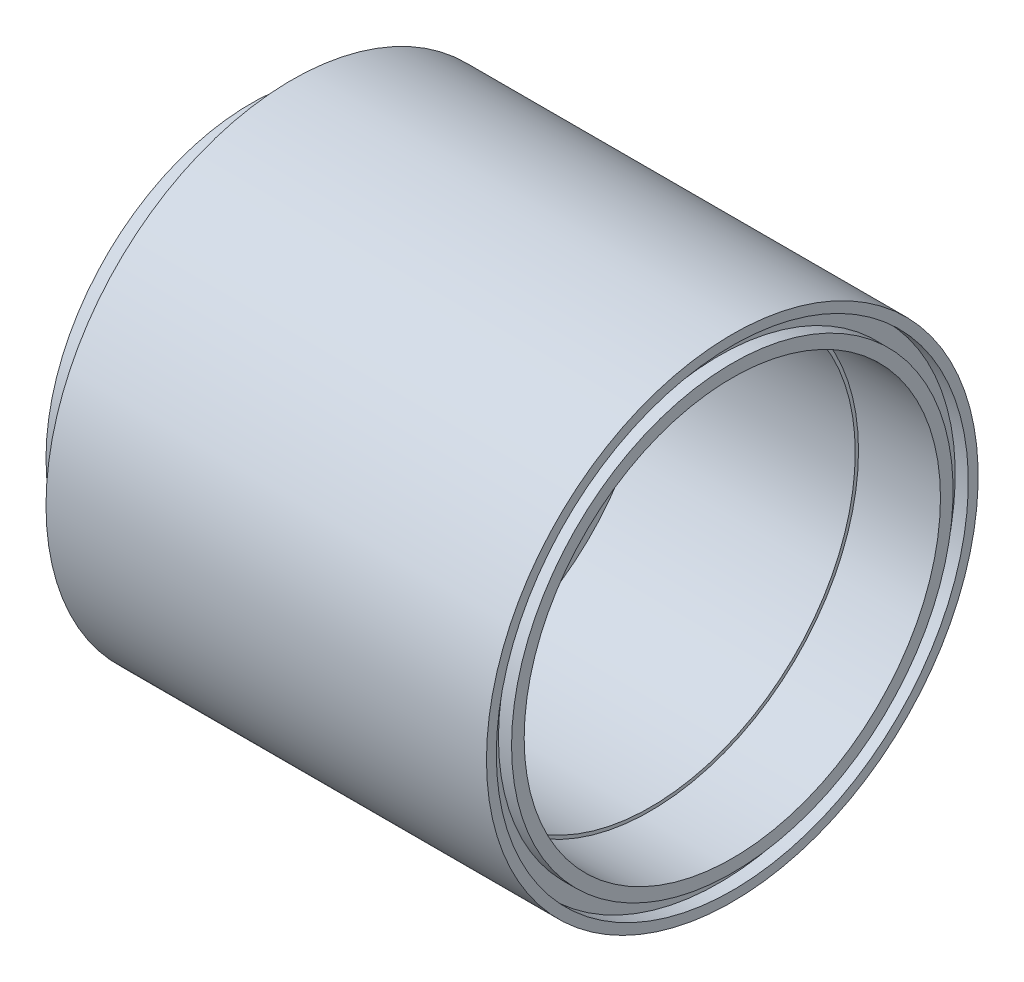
ISO-10303-21;
HEADER;
FILE_DESCRIPTION(('STEP AP214'),'2;1');
FILE_NAME('part.step','',(''),(''),'','','');
FILE_SCHEMA(('AUTOMOTIVE_DESIGN { 1 0 10303 214 1 1 1 1 }'));
ENDSEC;
DATA;
#1=APPLICATION_CONTEXT('core data for automotive mechanical design processes');
#2=APPLICATION_PROTOCOL_DEFINITION('international standard','automotive_design',2000,#1);
#3=PRODUCT_CONTEXT('',#1,'mechanical');
#4=PRODUCT('Part','Part','',(#3));
#5=PRODUCT_RELATED_PRODUCT_CATEGORY('part','',(#4));
#6=PRODUCT_DEFINITION_FORMATION('','',#4);
#7=PRODUCT_DEFINITION_CONTEXT('part definition',#1,'design');
#8=PRODUCT_DEFINITION('design','',#6,#7);
#9=PRODUCT_DEFINITION_SHAPE('','',#8);
#10=(LENGTH_UNIT() NAMED_UNIT(*) SI_UNIT(.MILLI.,.METRE.));
#11=(NAMED_UNIT(*) PLANE_ANGLE_UNIT() SI_UNIT($,.RADIAN.));
#12=(NAMED_UNIT(*) SI_UNIT($,.STERADIAN.) SOLID_ANGLE_UNIT());
#13=UNCERTAINTY_MEASURE_WITH_UNIT(LENGTH_MEASURE(1.E-05),#10,'distance_accuracy_value','');
#14=(GEOMETRIC_REPRESENTATION_CONTEXT(3) GLOBAL_UNCERTAINTY_ASSIGNED_CONTEXT((#13)) GLOBAL_UNIT_ASSIGNED_CONTEXT((#10,
#11,#12)) REPRESENTATION_CONTEXT('',''));
#15=CARTESIAN_POINT('',(0.,0.,0.));
#16=DIRECTION('',(0.,0.,1.));
#17=DIRECTION('',(1.,0.,0.));
#18=AXIS2_PLACEMENT_3D('',#15,#16,#17);
#19=CARTESIAN_POINT('',(-4.7625,0.,0.));
#20=DIRECTION('',(-1.,0.,0.));
#21=DIRECTION('',(0.,0.,1.));
#22=AXIS2_PLACEMENT_3D('',#19,#20,#21);
#23=CYLINDRICAL_SURFACE('',#22,27.051);
#24=CARTESIAN_POINT('',(-11.1125,0.,0.));
#25=DIRECTION('',(-1.,0.,0.));
#26=DIRECTION('',(0.,0.,1.));
#27=AXIS2_PLACEMENT_3D('',#24,#25,#26);
#28=CIRCLE('',#27,27.051);
#29=CARTESIAN_POINT('',(-11.1125,0.,27.051));
#30=VERTEX_POINT('',#29);
#31=EDGE_CURVE('E101',#30,#30,#28,.T.);
#32=ORIENTED_EDGE('',*,*,#31,.T.);
#33=EDGE_LOOP('',(#32));
#34=FACE_BOUND('',#33,.T.);
#35=CARTESIAN_POINT('',(-9.4615,0.,0.));
#36=DIRECTION('',(-1.,0.,0.));
#37=DIRECTION('',(0.,0.,1.));
#38=AXIS2_PLACEMENT_3D('',#35,#36,#37);
#39=CIRCLE('',#38,27.051);
#40=CARTESIAN_POINT('',(-9.4615,0.,27.051));
#41=VERTEX_POINT('',#40);
#42=EDGE_CURVE('E10',#41,#41,#39,.T.);
#43=ORIENTED_EDGE('',*,*,#42,.F.);
#44=EDGE_LOOP('',(#43));
#45=FACE_BOUND('',#44,.T.);
#46=ADVANCED_FACE('F37',(#34,#45),#23,.F.);
#47=CARTESIAN_POINT('',(-9.4615,0.,0.));
#48=DIRECTION('',(-1.,0.,0.));
#49=DIRECTION('',(0.,0.,1.));
#50=AXIS2_PLACEMENT_3D('',#47,#48,#49);
#51=PLANE('',#50);
#52=ORIENTED_EDGE('',*,*,#42,.T.);
#53=EDGE_LOOP('',(#52));
#54=FACE_BOUND('',#53,.T.);
#55=CARTESIAN_POINT('',(-9.4615,0.,0.));
#56=DIRECTION('',(-1.,0.,0.));
#57=DIRECTION('',(0.,0.,1.));
#58=AXIS2_PLACEMENT_3D('',#55,#56,#57);
#59=CIRCLE('',#58,25.4);
#60=CARTESIAN_POINT('',(-9.4615,0.,25.4));
#61=VERTEX_POINT('',#60);
#62=EDGE_CURVE('E43',#61,#61,#59,.T.);
#63=ORIENTED_EDGE('',*,*,#62,.F.);
#64=EDGE_LOOP('',(#63));
#65=FACE_BOUND('',#64,.T.);
#66=ADVANCED_FACE('F229',(#54,#65),#51,.T.);
#67=CARTESIAN_POINT('',(-4.7625,0.,0.));
#68=DIRECTION('',(-1.,0.,0.));
#69=DIRECTION('',(0.,0.,1.));
#70=AXIS2_PLACEMENT_3D('',#67,#68,#69);
#71=CYLINDRICAL_SURFACE('',#70,25.4);
#72=ORIENTED_EDGE('',*,*,#62,.T.);
#73=EDGE_LOOP('',(#72));
#74=FACE_BOUND('',#73,.T.);
#75=CARTESIAN_POINT('',(-11.1125,0.,0.));
#76=DIRECTION('',(-1.,0.,0.));
#77=DIRECTION('',(0.,0.,1.));
#78=AXIS2_PLACEMENT_3D('',#75,#76,#77);
#79=CIRCLE('',#78,25.4);
#80=CARTESIAN_POINT('',(-11.1125,0.,25.4));
#81=VERTEX_POINT('',#80);
#82=EDGE_CURVE('E47',#81,#81,#79,.T.);
#83=ORIENTED_EDGE('',*,*,#82,.F.);
#84=EDGE_LOOP('',(#83));
#85=FACE_BOUND('',#84,.T.);
#86=ADVANCED_FACE('F234',(#74,#85),#71,.T.);
#87=CARTESIAN_POINT('',(-11.1125,0.,0.));
#88=DIRECTION('',(1.,0.,0.));
#89=DIRECTION('',(0.,0.,-1.));
#90=AXIS2_PLACEMENT_3D('',#87,#88,#89);
#91=PLANE('',#90);
#92=CARTESIAN_POINT('',(-11.1125,0.,0.));
#93=DIRECTION('',(-1.,0.,0.));
#94=DIRECTION('',(0.,0.,1.));
#95=AXIS2_PLACEMENT_3D('',#92,#93,#94);
#96=CIRCLE('',#95,22.86);
#97=CARTESIAN_POINT('',(-11.1125,0.,22.86));
#98=VERTEX_POINT('',#97);
#99=EDGE_CURVE('E51',#98,#98,#96,.T.);
#100=ORIENTED_EDGE('',*,*,#99,.F.);
#101=EDGE_LOOP('',(#100));
#102=FACE_BOUND('',#101,.T.);
#103=ORIENTED_EDGE('',*,*,#82,.T.);
#104=EDGE_LOOP('',(#103));
#105=FACE_BOUND('',#104,.T.);
#106=ADVANCED_FACE('F244',(#102,#105),#91,.F.);
#107=CARTESIAN_POINT('',(-4.7625,0.,0.));
#108=DIRECTION('',(-1.,0.,0.));
#109=DIRECTION('',(0.,0.,1.));
#110=AXIS2_PLACEMENT_3D('',#107,#108,#109);
#111=CYLINDRICAL_SURFACE('',#110,22.86);
#112=CARTESIAN_POINT('',(-4.7625,0.,0.));
#113=DIRECTION('',(-1.,0.,0.));
#114=DIRECTION('',(0.,0.,1.));
#115=AXIS2_PLACEMENT_3D('',#112,#113,#114);
#116=CIRCLE('',#115,22.86);
#117=CARTESIAN_POINT('',(-4.7625,0.,22.86));
#118=VERTEX_POINT('',#117);
#119=EDGE_CURVE('E56',#118,#118,#116,.T.);
#120=ORIENTED_EDGE('',*,*,#119,.F.);
#121=EDGE_LOOP('',(#120));
#122=FACE_BOUND('',#121,.T.);
#123=ORIENTED_EDGE('',*,*,#99,.T.);
#124=EDGE_LOOP('',(#123));
#125=FACE_BOUND('',#124,.T.);
#126=ADVANCED_FACE('F433',(#122,#125),#111,.F.);
#127=CARTESIAN_POINT('',(-4.7625,0.,0.));
#128=DIRECTION('',(1.,0.,0.));
#129=DIRECTION('',(0.,0.,-1.));
#130=AXIS2_PLACEMENT_3D('',#127,#128,#129);
#131=PLANE('',#130);
#132=CARTESIAN_POINT('',(-4.7625,6.35,0.));
#133=DIRECTION('',(-1.,0.,0.));
#134=DIRECTION('',(0.,0.,1.));
#135=AXIS2_PLACEMENT_3D('',#132,#133,#134);
#136=CIRCLE('',#135,2.54);
#137=CARTESIAN_POINT('',(-4.7625,6.35,2.54));
#138=VERTEX_POINT('',#137);
#139=EDGE_CURVE('E119',#138,#138,#136,.T.);
#140=ORIENTED_EDGE('',*,*,#139,.F.);
#141=EDGE_LOOP('',(#140));
#142=FACE_BOUND('',#141,.T.);
#143=CARTESIAN_POINT('',(-4.7625,0.,8.509));
#144=DIRECTION('',(-1.,0.,0.));
#145=DIRECTION('',(0.,0.,1.));
#146=AXIS2_PLACEMENT_3D('',#143,#144,#145);
#147=CIRCLE('',#146,1.778);
#148=CARTESIAN_POINT('',(-4.7625,0.,10.287));
#149=VERTEX_POINT('',#148);
#150=EDGE_CURVE('E113',#149,#149,#147,.T.);
#151=ORIENTED_EDGE('',*,*,#150,.F.);
#152=EDGE_LOOP('',(#151));
#153=FACE_BOUND('',#152,.T.);
#154=CARTESIAN_POINT('',(-4.7625,0.,-8.509));
#155=DIRECTION('',(-1.,0.,0.));
#156=DIRECTION('',(0.,0.,1.));
#157=AXIS2_PLACEMENT_3D('',#154,#155,#156);
#158=CIRCLE('',#157,1.778);
#159=CARTESIAN_POINT('',(-4.7625,0.,-6.731));
#160=VERTEX_POINT('',#159);
#161=EDGE_CURVE('E107',#160,#160,#158,.T.);
#162=ORIENTED_EDGE('',*,*,#161,.F.);
#163=EDGE_LOOP('',(#162));
#164=FACE_BOUND('',#163,.T.);
#165=ORIENTED_EDGE('',*,*,#119,.T.);
#166=EDGE_LOOP('',(#165));
#167=FACE_BOUND('',#166,.T.);
#168=ADVANCED_FACE('F153',(#142,#153,#164,#167),#131,.F.);
#169=CARTESIAN_POINT('',(0.,0.,0.));
#170=DIRECTION('',(-1.,0.,0.));
#171=DIRECTION('',(0.,0.,1.));
#172=AXIS2_PLACEMENT_3D('',#169,#170,#171);
#173=PLANE('',#172);
#174=CARTESIAN_POINT('',(0.,23.114,0.));
#175=DIRECTION('',(1.,0.,0.));
#176=DIRECTION('',(0.,0.,-1.));
#177=AXIS2_PLACEMENT_3D('',#174,#175,#176);
#178=CIRCLE('',#177,0.88899999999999);
#179=CARTESIAN_POINT('',(0.,23.114,-0.88899999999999));
#180=VERTEX_POINT('',#179);
#181=EDGE_CURVE('E143',#180,#180,#178,.T.);
#182=ORIENTED_EDGE('',*,*,#181,.F.);
#183=EDGE_LOOP('',(#182));
#184=FACE_BOUND('',#183,.T.);
#185=CARTESIAN_POINT('',(0.,0.,-23.114));
#186=DIRECTION('',(1.,0.,0.));
#187=DIRECTION('',(0.,0.,-1.));
#188=AXIS2_PLACEMENT_3D('',#185,#186,#187);
#189=CIRCLE('',#188,0.888999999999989);
#190=CARTESIAN_POINT('',(0.,0.,-24.003));
#191=VERTEX_POINT('',#190);
#192=EDGE_CURVE('E137',#191,#191,#189,.T.);
#193=ORIENTED_EDGE('',*,*,#192,.F.);
#194=EDGE_LOOP('',(#193));
#195=FACE_BOUND('',#194,.T.);
#196=CARTESIAN_POINT('',(0.,-23.114,0.));
#197=DIRECTION('',(1.,0.,0.));
#198=DIRECTION('',(0.,0.,-1.));
#199=AXIS2_PLACEMENT_3D('',#196,#197,#198);
#200=CIRCLE('',#199,0.88899999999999);
#201=CARTESIAN_POINT('',(0.,-23.114,-0.88899999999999));
#202=VERTEX_POINT('',#201);
#203=EDGE_CURVE('E131',#202,#202,#200,.T.);
#204=ORIENTED_EDGE('',*,*,#203,.F.);
#205=EDGE_LOOP('',(#204));
#206=FACE_BOUND('',#205,.T.);
#207=CARTESIAN_POINT('',(0.,0.,23.114));
#208=DIRECTION('',(1.,0.,0.));
#209=DIRECTION('',(0.,0.,-1.));
#210=AXIS2_PLACEMENT_3D('',#207,#208,#209);
#211=CIRCLE('',#210,0.888999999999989);
#212=CARTESIAN_POINT('',(0.,0.,22.225));
#213=VERTEX_POINT('',#212);
#214=EDGE_CURVE('E125',#213,#213,#211,.T.);
#215=ORIENTED_EDGE('',*,*,#214,.F.);
#216=EDGE_LOOP('',(#215));
#217=FACE_BOUND('',#216,.T.);
#218=CARTESIAN_POINT('',(0.,6.35,0.));
#219=DIRECTION('',(-1.,0.,0.));
#220=DIRECTION('',(0.,0.,1.));
#221=AXIS2_PLACEMENT_3D('',#218,#219,#220);
#222=CIRCLE('',#221,2.54);
#223=CARTESIAN_POINT('',(0.,6.35,2.54));
#224=VERTEX_POINT('',#223);
#225=EDGE_CURVE('E116',#224,#224,#222,.F.);
#226=ORIENTED_EDGE('',*,*,#225,.F.);
#227=EDGE_LOOP('',(#226));
#228=FACE_BOUND('',#227,.T.);
#229=CARTESIAN_POINT('',(0.,0.,8.509));
#230=DIRECTION('',(-1.,0.,0.));
#231=DIRECTION('',(0.,0.,1.));
#232=AXIS2_PLACEMENT_3D('',#229,#230,#231);
#233=CIRCLE('',#232,1.778);
#234=CARTESIAN_POINT('',(0.,0.,10.287));
#235=VERTEX_POINT('',#234);
#236=EDGE_CURVE('E110',#235,#235,#233,.F.);
#237=ORIENTED_EDGE('',*,*,#236,.F.);
#238=EDGE_LOOP('',(#237));
#239=FACE_BOUND('',#238,.T.);
#240=CARTESIAN_POINT('',(0.,0.,-8.509));
#241=DIRECTION('',(-1.,0.,0.));
#242=DIRECTION('',(0.,0.,1.));
#243=AXIS2_PLACEMENT_3D('',#240,#241,#242);
#244=CIRCLE('',#243,1.778);
#245=CARTESIAN_POINT('',(0.,0.,-6.731));
#246=VERTEX_POINT('',#245);
#247=EDGE_CURVE('E104',#246,#246,#244,.F.);
#248=ORIENTED_EDGE('',*,*,#247,.F.);
#249=EDGE_LOOP('',(#248));
#250=FACE_BOUND('',#249,.T.);
#251=CARTESIAN_POINT('',(0.,0.,0.));
#252=DIRECTION('',(-1.,0.,0.));
#253=DIRECTION('',(0.,0.,1.));
#254=AXIS2_PLACEMENT_3D('',#251,#252,#253);
#255=CIRCLE('',#254,31.75);
#256=CARTESIAN_POINT('',(0.,0.,31.75));
#257=VERTEX_POINT('',#256);
#258=EDGE_CURVE('E59',#257,#257,#255,.T.);
#259=ORIENTED_EDGE('',*,*,#258,.F.);
#260=EDGE_LOOP('',(#259));
#261=FACE_BOUND('',#260,.T.);
#262=ADVANCED_FACE('F149',(#184,#195,#206,#217,#228,#239,#250,#261),#173,.F.);
#263=CARTESIAN_POINT('',(-4.7625,0.,0.));
#264=DIRECTION('',(-1.,0.,0.));
#265=DIRECTION('',(0.,0.,1.));
#266=AXIS2_PLACEMENT_3D('',#263,#264,#265);
#267=CYLINDRICAL_SURFACE('',#266,31.75);
#268=ORIENTED_EDGE('',*,*,#258,.T.);
#269=EDGE_LOOP('',(#268));
#270=FACE_BOUND('',#269,.T.);
#271=CARTESIAN_POINT('',(31.75,0.,0.));
#272=DIRECTION('',(-1.,0.,0.));
#273=DIRECTION('',(0.,0.,1.));
#274=AXIS2_PLACEMENT_3D('',#271,#272,#273);
#275=CIRCLE('',#274,31.75);
#276=CARTESIAN_POINT('',(31.75,0.,31.75));
#277=VERTEX_POINT('',#276);
#278=EDGE_CURVE('E62',#277,#277,#275,.T.);
#279=ORIENTED_EDGE('',*,*,#278,.F.);
#280=EDGE_LOOP('',(#279));
#281=FACE_BOUND('',#280,.T.);
#282=ADVANCED_FACE('F152',(#270,#281),#267,.F.);
#283=CARTESIAN_POINT('',(31.75,0.,0.));
#284=DIRECTION('',(1.,0.,0.));
#285=DIRECTION('',(0.,0.,-1.));
#286=AXIS2_PLACEMENT_3D('',#283,#284,#285);
#287=PLANE('',#286);
#288=ORIENTED_EDGE('',*,*,#278,.T.);
#289=EDGE_LOOP('',(#288));
#290=FACE_BOUND('',#289,.T.);
#291=CARTESIAN_POINT('',(31.75,0.,0.));
#292=DIRECTION('',(-1.,0.,0.));
#293=DIRECTION('',(0.,0.,1.));
#294=AXIS2_PLACEMENT_3D('',#291,#292,#293);
#295=CIRCLE('',#294,32.258);
#296=CARTESIAN_POINT('',(31.75,0.,32.258));
#297=VERTEX_POINT('',#296);
#298=EDGE_CURVE('E65',#297,#297,#295,.T.);
#299=ORIENTED_EDGE('',*,*,#298,.F.);
#300=EDGE_LOOP('',(#299));
#301=FACE_BOUND('',#300,.T.);
#302=ADVANCED_FACE('F171',(#290,#301),#287,.T.);
#303=CARTESIAN_POINT('',(-4.7625,0.,0.));
#304=DIRECTION('',(-1.,0.,0.));
#305=DIRECTION('',(0.,0.,1.));
#306=AXIS2_PLACEMENT_3D('',#303,#304,#305);
#307=CYLINDRICAL_SURFACE('',#306,32.258);
#308=ORIENTED_EDGE('',*,*,#298,.T.);
#309=EDGE_LOOP('',(#308));
#310=FACE_BOUND('',#309,.T.);
#311=CARTESIAN_POINT('',(44.45,0.,0.));
#312=DIRECTION('',(-1.,0.,0.));
#313=DIRECTION('',(0.,0.,1.));
#314=AXIS2_PLACEMENT_3D('',#311,#312,#313);
#315=CIRCLE('',#314,32.258);
#316=CARTESIAN_POINT('',(44.45,0.,32.258));
#317=VERTEX_POINT('',#316);
#318=EDGE_CURVE('E68',#317,#317,#315,.T.);
#319=ORIENTED_EDGE('',*,*,#318,.F.);
#320=EDGE_LOOP('',(#319));
#321=FACE_BOUND('',#320,.T.);
#322=ADVANCED_FACE('F177',(#310,#321),#307,.F.);
#323=CARTESIAN_POINT('',(44.45,0.,0.));
#324=DIRECTION('',(1.,0.,0.));
#325=DIRECTION('',(0.,0.,-1.));
#326=AXIS2_PLACEMENT_3D('',#323,#324,#325);
#327=PLANE('',#326);
#328=ORIENTED_EDGE('',*,*,#318,.T.);
#329=EDGE_LOOP('',(#328));
#330=FACE_BOUND('',#329,.T.);
#331=CARTESIAN_POINT('',(44.45,0.,0.));
#332=DIRECTION('',(-1.,0.,0.));
#333=DIRECTION('',(0.,0.,1.));
#334=AXIS2_PLACEMENT_3D('',#331,#332,#333);
#335=CIRCLE('',#334,34.2138);
#336=CARTESIAN_POINT('',(44.45,0.,34.2138));
#337=VERTEX_POINT('',#336);
#338=EDGE_CURVE('E71',#337,#337,#335,.T.);
#339=ORIENTED_EDGE('',*,*,#338,.F.);
#340=EDGE_LOOP('',(#339));
#341=FACE_BOUND('',#340,.T.);
#342=ADVANCED_FACE('F183',(#330,#341),#327,.T.);
#343=CARTESIAN_POINT('',(-4.7625,0.,0.));
#344=DIRECTION('',(-1.,0.,0.));
#345=DIRECTION('',(0.,0.,1.));
#346=AXIS2_PLACEMENT_3D('',#343,#344,#345);
#347=CYLINDRICAL_SURFACE('',#346,34.2138);
#348=ORIENTED_EDGE('',*,*,#338,.T.);
#349=EDGE_LOOP('',(#348));
#350=FACE_BOUND('',#349,.T.);
#351=CARTESIAN_POINT('',(42.418,0.,0.));
#352=DIRECTION('',(-1.,0.,0.));
#353=DIRECTION('',(0.,0.,1.));
#354=AXIS2_PLACEMENT_3D('',#351,#352,#353);
#355=CIRCLE('',#354,34.2138);
#356=CARTESIAN_POINT('',(42.418,0.,34.2138));
#357=VERTEX_POINT('',#356);
#358=EDGE_CURVE('E74',#357,#357,#355,.T.);
#359=ORIENTED_EDGE('',*,*,#358,.F.);
#360=EDGE_LOOP('',(#359));
#361=FACE_BOUND('',#360,.T.);
#362=ADVANCED_FACE('F189',(#350,#361),#347,.T.);
#363=CARTESIAN_POINT('',(42.418,0.,0.));
#364=DIRECTION('',(1.,0.,0.));
#365=DIRECTION('',(0.,0.,-1.));
#366=AXIS2_PLACEMENT_3D('',#363,#364,#365);
#367=PLANE('',#366);
#368=ORIENTED_EDGE('',*,*,#358,.T.);
#369=EDGE_LOOP('',(#368));
#370=FACE_BOUND('',#369,.T.);
#371=CARTESIAN_POINT('',(42.418,0.,0.));
#372=DIRECTION('',(-1.,0.,0.));
#373=DIRECTION('',(0.,0.,1.));
#374=AXIS2_PLACEMENT_3D('',#371,#372,#373);
#375=CIRCLE('',#374,36.576);
#376=CARTESIAN_POINT('',(42.418,0.,36.576));
#377=VERTEX_POINT('',#376);
#378=EDGE_CURVE('E77',#377,#377,#375,.T.);
#379=ORIENTED_EDGE('',*,*,#378,.F.);
#380=EDGE_LOOP('',(#379));
#381=FACE_BOUND('',#380,.T.);
#382=ADVANCED_FACE('F195',(#370,#381),#367,.T.);
#383=CARTESIAN_POINT('',(-4.7625,0.,0.));
#384=DIRECTION('',(-1.,0.,0.));
#385=DIRECTION('',(0.,0.,1.));
#386=AXIS2_PLACEMENT_3D('',#383,#384,#385);
#387=CYLINDRICAL_SURFACE('',#386,36.576);
#388=ORIENTED_EDGE('',*,*,#378,.T.);
#389=EDGE_LOOP('',(#388));
#390=FACE_BOUND('',#389,.T.);
#391=CARTESIAN_POINT('',(44.45,0.,0.));
#392=DIRECTION('',(-1.,0.,0.));
#393=DIRECTION('',(0.,0.,1.));
#394=AXIS2_PLACEMENT_3D('',#391,#392,#393);
#395=CIRCLE('',#394,36.576);
#396=CARTESIAN_POINT('',(44.45,0.,36.576));
#397=VERTEX_POINT('',#396);
#398=EDGE_CURVE('E80',#397,#397,#395,.T.);
#399=ORIENTED_EDGE('',*,*,#398,.F.);
#400=EDGE_LOOP('',(#399));
#401=FACE_BOUND('',#400,.T.);
#402=ADVANCED_FACE('F201',(#390,#401),#387,.F.);
#403=CARTESIAN_POINT('',(44.45,0.,0.));
#404=DIRECTION('',(1.,0.,0.));
#405=DIRECTION('',(0.,0.,-1.));
#406=AXIS2_PLACEMENT_3D('',#403,#404,#405);
#407=PLANE('',#406);
#408=ORIENTED_EDGE('',*,*,#398,.T.);
#409=EDGE_LOOP('',(#408));
#410=FACE_BOUND('',#409,.T.);
#411=CARTESIAN_POINT('',(44.45,0.,0.));
#412=DIRECTION('',(-1.,0.,0.));
#413=DIRECTION('',(0.,0.,1.));
#414=AXIS2_PLACEMENT_3D('',#411,#412,#413);
#415=CIRCLE('',#414,38.1);
#416=CARTESIAN_POINT('',(44.45,0.,38.1));
#417=VERTEX_POINT('',#416);
#418=EDGE_CURVE('E83',#417,#417,#415,.T.);
#419=ORIENTED_EDGE('',*,*,#418,.F.);
#420=EDGE_LOOP('',(#419));
#421=FACE_BOUND('',#420,.T.);
#422=ADVANCED_FACE('F207',(#410,#421),#407,.T.);
#423=CARTESIAN_POINT('',(-4.7625,0.,0.));
#424=DIRECTION('',(-1.,0.,0.));
#425=DIRECTION('',(0.,0.,1.));
#426=AXIS2_PLACEMENT_3D('',#423,#424,#425);
#427=CYLINDRICAL_SURFACE('',#426,38.1);
#428=CARTESIAN_POINT('',(-23.8125,0.,0.));
#429=DIRECTION('',(-1.,0.,0.));
#430=DIRECTION('',(0.,0.,1.));
#431=AXIS2_PLACEMENT_3D('',#428,#429,#430);
#432=CIRCLE('',#431,38.1);
#433=CARTESIAN_POINT('',(-23.8125,0.,38.1));
#434=VERTEX_POINT('',#433);
#435=EDGE_CURVE('E86',#434,#434,#432,.T.);
#436=ORIENTED_EDGE('',*,*,#435,.F.);
#437=EDGE_LOOP('',(#436));
#438=FACE_BOUND('',#437,.T.);
#439=ORIENTED_EDGE('',*,*,#418,.T.);
#440=EDGE_LOOP('',(#439));
#441=FACE_BOUND('',#440,.T.);
#442=ADVANCED_FACE('F213',(#438,#441),#427,.T.);
#443=CARTESIAN_POINT('',(-23.8125,0.,0.));
#444=DIRECTION('',(1.,0.,0.));
#445=DIRECTION('',(0.,0.,-1.));
#446=AXIS2_PLACEMENT_3D('',#443,#444,#445);
#447=PLANE('',#446);
#448=CARTESIAN_POINT('',(-23.8125,0.,0.));
#449=DIRECTION('',(-1.,0.,0.));
#450=DIRECTION('',(0.,0.,1.));
#451=AXIS2_PLACEMENT_3D('',#448,#449,#450);
#452=CIRCLE('',#451,31.75);
#453=CARTESIAN_POINT('',(-23.8125,0.,31.75));
#454=VERTEX_POINT('',#453);
#455=EDGE_CURVE('E89',#454,#454,#452,.T.);
#456=ORIENTED_EDGE('',*,*,#455,.F.);
#457=EDGE_LOOP('',(#456));
#458=FACE_BOUND('',#457,.T.);
#459=ORIENTED_EDGE('',*,*,#435,.T.);
#460=EDGE_LOOP('',(#459));
#461=FACE_BOUND('',#460,.T.);
#462=ADVANCED_FACE('F218',(#458,#461),#447,.F.);
#463=CARTESIAN_POINT('',(-4.7625,0.,0.));
#464=DIRECTION('',(-1.,0.,0.));
#465=DIRECTION('',(0.,0.,1.));
#466=AXIS2_PLACEMENT_3D('',#463,#464,#465);
#467=CYLINDRICAL_SURFACE('',#466,31.75);
#468=CARTESIAN_POINT('',(-30.1625,0.,0.));
#469=DIRECTION('',(-1.,0.,0.));
#470=DIRECTION('',(0.,0.,1.));
#471=AXIS2_PLACEMENT_3D('',#468,#469,#470);
#472=CIRCLE('',#471,31.75);
#473=CARTESIAN_POINT('',(-30.1625,0.,31.75));
#474=VERTEX_POINT('',#473);
#475=EDGE_CURVE('E92',#474,#474,#472,.T.);
#476=ORIENTED_EDGE('',*,*,#475,.F.);
#477=EDGE_LOOP('',(#476));
#478=FACE_BOUND('',#477,.T.);
#479=ORIENTED_EDGE('',*,*,#455,.T.);
#480=EDGE_LOOP('',(#479));
#481=FACE_BOUND('',#480,.T.);
#482=ADVANCED_FACE('F224',(#478,#481),#467,.T.);
#483=CARTESIAN_POINT('',(-30.1625,0.,0.));
#484=DIRECTION('',(1.,0.,0.));
#485=DIRECTION('',(0.,0.,-1.));
#486=AXIS2_PLACEMENT_3D('',#483,#484,#485);
#487=PLANE('',#486);
#488=CARTESIAN_POINT('',(-30.1625,0.,0.));
#489=DIRECTION('',(-1.,0.,0.));
#490=DIRECTION('',(0.,0.,1.));
#491=AXIS2_PLACEMENT_3D('',#488,#489,#490);
#492=CIRCLE('',#491,28.8925);
#493=CARTESIAN_POINT('',(-30.1625,0.,28.8925));
#494=VERTEX_POINT('',#493);
#495=EDGE_CURVE('E95',#494,#494,#492,.T.);
#496=ORIENTED_EDGE('',*,*,#495,.F.);
#497=EDGE_LOOP('',(#496));
#498=FACE_BOUND('',#497,.T.);
#499=ORIENTED_EDGE('',*,*,#475,.T.);
#500=EDGE_LOOP('',(#499));
#501=FACE_BOUND('',#500,.T.);
#502=ADVANCED_FACE('F249',(#498,#501),#487,.F.);
#503=CARTESIAN_POINT('',(-4.7625,0.,0.));
#504=DIRECTION('',(-1.,0.,0.));
#505=DIRECTION('',(0.,0.,1.));
#506=AXIS2_PLACEMENT_3D('',#503,#504,#505);
#507=CYLINDRICAL_SURFACE('',#506,28.8925);
#508=CARTESIAN_POINT('',(-11.1125,0.,0.));
#509=DIRECTION('',(-1.,0.,0.));
#510=DIRECTION('',(0.,0.,1.));
#511=AXIS2_PLACEMENT_3D('',#508,#509,#510);
#512=CIRCLE('',#511,28.8925);
#513=CARTESIAN_POINT('',(-11.1125,0.,28.8925));
#514=VERTEX_POINT('',#513);
#515=EDGE_CURVE('E98',#514,#514,#512,.T.);
#516=ORIENTED_EDGE('',*,*,#515,.F.);
#517=EDGE_LOOP('',(#516));
#518=FACE_BOUND('',#517,.T.);
#519=ORIENTED_EDGE('',*,*,#495,.T.);
#520=EDGE_LOOP('',(#519));
#521=FACE_BOUND('',#520,.T.);
#522=ADVANCED_FACE('F242',(#518,#521),#507,.F.);
#523=ORIENTED_EDGE('',*,*,#31,.F.);
#524=EDGE_LOOP('',(#523));
#525=FACE_BOUND('',#524,.T.);
#526=ORIENTED_EDGE('',*,*,#515,.T.);
#527=EDGE_LOOP('',(#526));
#528=FACE_BOUND('',#527,.T.);
#529=ADVANCED_FACE('F238',(#525,#528),#91,.F.);
#530=CARTESIAN_POINT('',(44.451,0.,-8.509));
#531=DIRECTION('',(-1.,0.,0.));
#532=DIRECTION('',(0.,0.,1.));
#533=AXIS2_PLACEMENT_3D('',#530,#531,#532);
#534=CYLINDRICAL_SURFACE('',#533,1.778);
#535=ORIENTED_EDGE('',*,*,#161,.T.);
#536=EDGE_LOOP('',(#535));
#537=FACE_BOUND('',#536,.T.);
#538=ORIENTED_EDGE('',*,*,#247,.T.);
#539=EDGE_LOOP('',(#538));
#540=FACE_BOUND('',#539,.T.);
#541=ADVANCED_FACE('F241',(#537,#540),#534,.F.);
#542=CARTESIAN_POINT('',(44.451,0.,8.509));
#543=DIRECTION('',(-1.,0.,0.));
#544=DIRECTION('',(0.,0.,1.));
#545=AXIS2_PLACEMENT_3D('',#542,#543,#544);
#546=CYLINDRICAL_SURFACE('',#545,1.778);
#547=ORIENTED_EDGE('',*,*,#150,.T.);
#548=EDGE_LOOP('',(#547));
#549=FACE_BOUND('',#548,.T.);
#550=ORIENTED_EDGE('',*,*,#236,.T.);
#551=EDGE_LOOP('',(#550));
#552=FACE_BOUND('',#551,.T.);
#553=ADVANCED_FACE('F268',(#549,#552),#546,.F.);
#554=CARTESIAN_POINT('',(44.451,6.35,0.));
#555=DIRECTION('',(-1.,0.,0.));
#556=DIRECTION('',(0.,0.,1.));
#557=AXIS2_PLACEMENT_3D('',#554,#555,#556);
#558=CYLINDRICAL_SURFACE('',#557,2.54);
#559=ORIENTED_EDGE('',*,*,#139,.T.);
#560=EDGE_LOOP('',(#559));
#561=FACE_BOUND('',#560,.T.);
#562=ORIENTED_EDGE('',*,*,#225,.T.);
#563=EDGE_LOOP('',(#562));
#564=FACE_BOUND('',#563,.T.);
#565=ADVANCED_FACE('F272',(#561,#564),#558,.F.);
#566=CARTESIAN_POINT('',(-4.318,0.,23.114));
#567=DIRECTION('',(-1.,0.,0.));
#568=DIRECTION('',(0.,0.,1.));
#569=AXIS2_PLACEMENT_3D('',#566,#567,#568);
#570=PLANE('',#569);
#571=CARTESIAN_POINT('',(-4.318,0.,23.114));
#572=DIRECTION('',(1.,0.,0.));
#573=DIRECTION('',(0.,0.,-1.));
#574=AXIS2_PLACEMENT_3D('',#571,#572,#573);
#575=CIRCLE('',#574,0.888999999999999);
#576=CARTESIAN_POINT('',(-4.318,0.,22.225));
#577=VERTEX_POINT('',#576);
#578=EDGE_CURVE('E122',#577,#577,#575,.T.);
#579=ORIENTED_EDGE('',*,*,#578,.T.);
#580=EDGE_LOOP('',(#579));
#581=FACE_BOUND('',#580,.T.);
#582=ADVANCED_FACE('F276',(#581),#570,.F.);
#583=CARTESIAN_POINT('',(0.,0.,23.114));
#584=DIRECTION('',(1.,0.,0.));
#585=DIRECTION('',(0.,0.,-1.));
#586=AXIS2_PLACEMENT_3D('',#583,#584,#585);
#587=CYLINDRICAL_SURFACE('',#586,0.888999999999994);
#588=ORIENTED_EDGE('',*,*,#578,.F.);
#589=EDGE_LOOP('',(#588));
#590=FACE_BOUND('',#589,.T.);
#591=ORIENTED_EDGE('',*,*,#214,.T.);
#592=EDGE_LOOP('',(#591));
#593=FACE_BOUND('',#592,.T.);
#594=ADVANCED_FACE('F280',(#590,#593),#587,.F.);
#595=CARTESIAN_POINT('',(-4.318,-23.114,0.));
#596=DIRECTION('',(-1.,0.,0.));
#597=DIRECTION('',(0.,0.,1.));
#598=AXIS2_PLACEMENT_3D('',#595,#596,#597);
#599=PLANE('',#598);
#600=CARTESIAN_POINT('',(-4.318,-23.114,0.));
#601=DIRECTION('',(1.,0.,0.));
#602=DIRECTION('',(0.,0.,-1.));
#603=AXIS2_PLACEMENT_3D('',#600,#601,#602);
#604=CIRCLE('',#603,0.888999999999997);
#605=CARTESIAN_POINT('',(-4.318,-23.114,-0.888999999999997));
#606=VERTEX_POINT('',#605);
#607=EDGE_CURVE('E128',#606,#606,#604,.T.);
#608=ORIENTED_EDGE('',*,*,#607,.T.);
#609=EDGE_LOOP('',(#608));
#610=FACE_BOUND('',#609,.T.);
#611=ADVANCED_FACE('F284',(#610),#599,.F.);
#612=CARTESIAN_POINT('',(0.,-23.114,0.));
#613=DIRECTION('',(1.,0.,0.));
#614=DIRECTION('',(0.,0.,-1.));
#615=AXIS2_PLACEMENT_3D('',#612,#613,#614);
#616=CYLINDRICAL_SURFACE('',#615,0.888999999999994);
#617=ORIENTED_EDGE('',*,*,#607,.F.);
#618=EDGE_LOOP('',(#617));
#619=FACE_BOUND('',#618,.T.);
#620=ORIENTED_EDGE('',*,*,#203,.T.);
#621=EDGE_LOOP('',(#620));
#622=FACE_BOUND('',#621,.T.);
#623=ADVANCED_FACE('F288',(#619,#622),#616,.F.);
#624=CARTESIAN_POINT('',(-4.318,0.,-23.114));
#625=DIRECTION('',(-1.,0.,0.));
#626=DIRECTION('',(0.,0.,1.));
#627=AXIS2_PLACEMENT_3D('',#624,#625,#626);
#628=PLANE('',#627);
#629=CARTESIAN_POINT('',(-4.318,0.,-23.114));
#630=DIRECTION('',(1.,0.,0.));
#631=DIRECTION('',(0.,0.,-1.));
#632=AXIS2_PLACEMENT_3D('',#629,#630,#631);
#633=CIRCLE('',#632,0.888999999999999);
#634=CARTESIAN_POINT('',(-4.318,0.,-24.003));
#635=VERTEX_POINT('',#634);
#636=EDGE_CURVE('E134',#635,#635,#633,.T.);
#637=ORIENTED_EDGE('',*,*,#636,.T.);
#638=EDGE_LOOP('',(#637));
#639=FACE_BOUND('',#638,.T.);
#640=ADVANCED_FACE('F292',(#639),#628,.F.);
#641=CARTESIAN_POINT('',(0.,0.,-23.114));
#642=DIRECTION('',(1.,0.,0.));
#643=DIRECTION('',(0.,0.,-1.));
#644=AXIS2_PLACEMENT_3D('',#641,#642,#643);
#645=CYLINDRICAL_SURFACE('',#644,0.888999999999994);
#646=ORIENTED_EDGE('',*,*,#636,.F.);
#647=EDGE_LOOP('',(#646));
#648=FACE_BOUND('',#647,.T.);
#649=ORIENTED_EDGE('',*,*,#192,.T.);
#650=EDGE_LOOP('',(#649));
#651=FACE_BOUND('',#650,.T.);
#652=ADVANCED_FACE('F296',(#648,#651),#645,.F.);
#653=CARTESIAN_POINT('',(-4.318,23.114,0.));
#654=DIRECTION('',(-1.,0.,0.));
#655=DIRECTION('',(0.,0.,1.));
#656=AXIS2_PLACEMENT_3D('',#653,#654,#655);
#657=PLANE('',#656);
#658=CARTESIAN_POINT('',(-4.318,23.114,0.));
#659=DIRECTION('',(1.,0.,0.));
#660=DIRECTION('',(0.,0.,-1.));
#661=AXIS2_PLACEMENT_3D('',#658,#659,#660);
#662=CIRCLE('',#661,0.888999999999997);
#663=CARTESIAN_POINT('',(-4.318,23.114,-0.888999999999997));
#664=VERTEX_POINT('',#663);
#665=EDGE_CURVE('E140',#664,#664,#662,.T.);
#666=ORIENTED_EDGE('',*,*,#665,.T.);
#667=EDGE_LOOP('',(#666));
#668=FACE_BOUND('',#667,.T.);
#669=ADVANCED_FACE('F300',(#668),#657,.F.);
#670=CARTESIAN_POINT('',(0.,23.114,0.));
#671=DIRECTION('',(1.,0.,0.));
#672=DIRECTION('',(0.,0.,-1.));
#673=AXIS2_PLACEMENT_3D('',#670,#671,#672);
#674=CYLINDRICAL_SURFACE('',#673,0.888999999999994);
#675=ORIENTED_EDGE('',*,*,#665,.F.);
#676=EDGE_LOOP('',(#675));
#677=FACE_BOUND('',#676,.T.);
#678=ORIENTED_EDGE('',*,*,#181,.T.);
#679=EDGE_LOOP('',(#678));
#680=FACE_BOUND('',#679,.T.);
#681=ADVANCED_FACE('F147',(#677,#680),#674,.F.);
#682=CLOSED_SHELL('',(#46,#66,#86,#106,#126,#168,#262,#282,#302,#322,#342,#362,#382,#402,#422,
#442,#462,#482,#502,#522,#529,#541,#553,#565,#582,#594,#611,#623,#640,#652,#669,#681));
#683=MANIFOLD_SOLID_BREP('B2',#682);
#684=ADVANCED_BREP_SHAPE_REPRESENTATION('',(#18,#683),#14);
#685=SHAPE_DEFINITION_REPRESENTATION(#9,#684);
ENDSEC;
END-ISO-10303-21;
